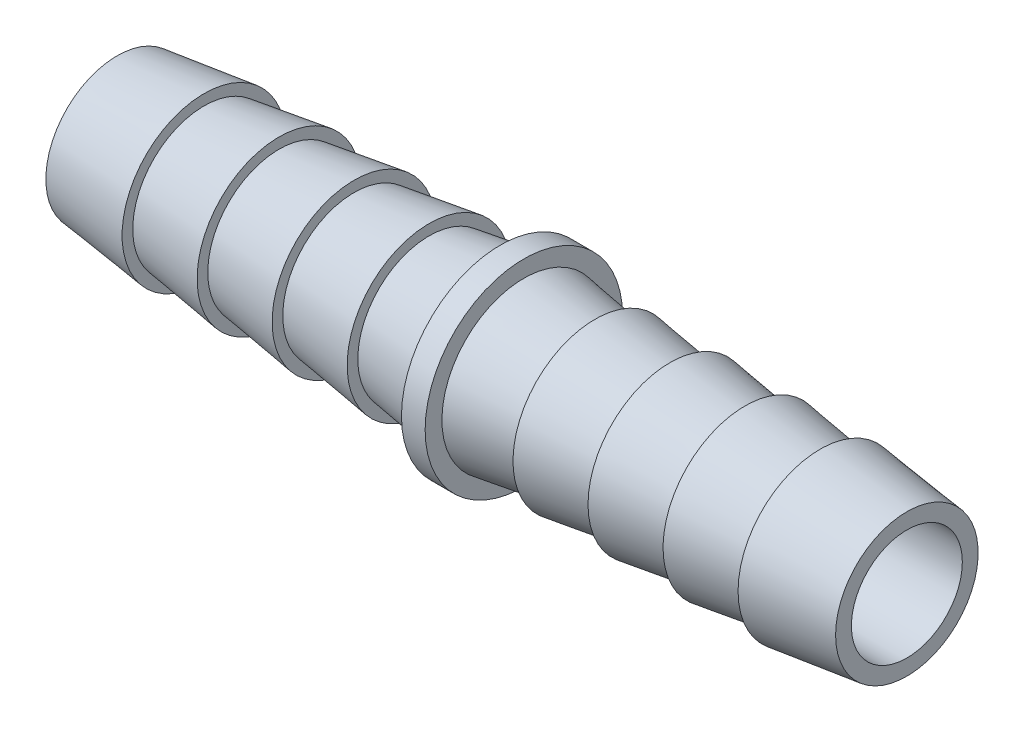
ISO-10303-21;
HEADER;
FILE_DESCRIPTION(('STEP AP214'),'2;1');
FILE_NAME('part.step','',(''),(''),'','','');
FILE_SCHEMA(('AUTOMOTIVE_DESIGN { 1 0 10303 214 1 1 1 1 }'));
ENDSEC;
DATA;
#1=APPLICATION_CONTEXT('core data for automotive mechanical design processes');
#2=APPLICATION_PROTOCOL_DEFINITION('international standard','automotive_design',2000,#1);
#3=PRODUCT_CONTEXT('',#1,'mechanical');
#4=PRODUCT('Part','Part','',(#3));
#5=PRODUCT_RELATED_PRODUCT_CATEGORY('part','',(#4));
#6=PRODUCT_DEFINITION_FORMATION('','',#4);
#7=PRODUCT_DEFINITION_CONTEXT('part definition',#1,'design');
#8=PRODUCT_DEFINITION('design','',#6,#7);
#9=PRODUCT_DEFINITION_SHAPE('','',#8);
#10=(LENGTH_UNIT() NAMED_UNIT(*) SI_UNIT(.MILLI.,.METRE.));
#11=(NAMED_UNIT(*) PLANE_ANGLE_UNIT() SI_UNIT($,.RADIAN.));
#12=(NAMED_UNIT(*) SI_UNIT($,.STERADIAN.) SOLID_ANGLE_UNIT());
#13=UNCERTAINTY_MEASURE_WITH_UNIT(LENGTH_MEASURE(1.E-05),#10,'distance_accuracy_value','');
#14=(GEOMETRIC_REPRESENTATION_CONTEXT(3) GLOBAL_UNCERTAINTY_ASSIGNED_CONTEXT((#13)) GLOBAL_UNIT_ASSIGNED_CONTEXT((#10,
#11,#12)) REPRESENTATION_CONTEXT('',''));
#15=CARTESIAN_POINT('',(0.,0.,0.));
#16=DIRECTION('',(0.,0.,1.));
#17=DIRECTION('',(1.,0.,0.));
#18=AXIS2_PLACEMENT_3D('',#15,#16,#17);
#19=CARTESIAN_POINT('',(0.,0.,0.));
#20=DIRECTION('',(-1.,0.,0.));
#21=DIRECTION('',(0.,0.,1.));
#22=AXIS2_PLACEMENT_3D('',#19,#20,#21);
#23=CYLINDRICAL_SURFACE('',#22,6.35);
#24=CARTESIAN_POINT('',(-0.762,0.,0.));
#25=DIRECTION('',(-1.,0.,0.));
#26=DIRECTION('',(0.,0.,1.));
#27=AXIS2_PLACEMENT_3D('',#24,#25,#26);
#28=CIRCLE('',#27,6.35);
#29=CARTESIAN_POINT('',(-0.762,0.,6.35));
#30=VERTEX_POINT('',#29);
#31=EDGE_CURVE('E86',#30,#30,#28,.T.);
#32=ORIENTED_EDGE('',*,*,#31,.F.);
#33=EDGE_LOOP('',(#32));
#34=FACE_BOUND('',#33,.T.);
#35=CARTESIAN_POINT('',(0.762,0.,0.));
#36=DIRECTION('',(-1.,0.,0.));
#37=DIRECTION('',(0.,0.,1.));
#38=AXIS2_PLACEMENT_3D('',#35,#36,#37);
#39=CIRCLE('',#38,6.35);
#40=CARTESIAN_POINT('',(0.762,0.,6.35));
#41=VERTEX_POINT('',#40);
#42=EDGE_CURVE('E16',#41,#41,#39,.T.);
#43=ORIENTED_EDGE('',*,*,#42,.T.);
#44=EDGE_LOOP('',(#43));
#45=FACE_BOUND('',#44,.T.);
#46=ADVANCED_FACE('F12',(#34,#45),#23,.T.);
#47=CARTESIAN_POINT('',(0.762,0.,0.));
#48=DIRECTION('',(-1.,0.,0.));
#49=DIRECTION('',(0.,0.,1.));
#50=AXIS2_PLACEMENT_3D('',#47,#48,#49);
#51=PLANE('',#50);
#52=CARTESIAN_POINT('',(0.761999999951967,0.,0.));
#53=DIRECTION('',(-1.,0.,0.));
#54=DIRECTION('',(0.,-1.,0.));
#55=AXIS2_PLACEMENT_3D('',#52,#53,#54);
#56=CIRCLE('',#55,5.27049999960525);
#57=CARTESIAN_POINT('',(0.761999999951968,-5.27049999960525,0.));
#58=VERTEX_POINT('',#57);
#59=EDGE_CURVE('E84',#58,#58,#56,.F.);
#60=ORIENTED_EDGE('',*,*,#59,.F.);
#61=EDGE_LOOP('',(#60));
#62=FACE_BOUND('',#61,.T.);
#63=ORIENTED_EDGE('',*,*,#42,.F.);
#64=EDGE_LOOP('',(#63));
#65=FACE_BOUND('',#64,.T.);
#66=ADVANCED_FACE('F94',(#62,#65),#51,.F.);
#67=CARTESIAN_POINT('',(-0.762,0.,0.));
#68=DIRECTION('',(-1.,0.,0.));
#69=DIRECTION('',(0.,0.,1.));
#70=AXIS2_PLACEMENT_3D('',#67,#68,#69);
#71=PLANE('',#70);
#72=CARTESIAN_POINT('',(-0.762,0.,0.));
#73=DIRECTION('',(1.,0.,0.));
#74=DIRECTION('',(0.,0.,-1.));
#75=AXIS2_PLACEMENT_3D('',#72,#73,#74);
#76=CIRCLE('',#75,5.2705);
#77=CARTESIAN_POINT('',(-0.762,0.,-5.2705));
#78=VERTEX_POINT('',#77);
#79=EDGE_CURVE('E81',#78,#78,#76,.F.);
#80=ORIENTED_EDGE('',*,*,#79,.F.);
#81=EDGE_LOOP('',(#80));
#82=FACE_BOUND('',#81,.T.);
#83=ORIENTED_EDGE('',*,*,#31,.T.);
#84=EDGE_LOOP('',(#83));
#85=FACE_BOUND('',#84,.T.);
#86=ADVANCED_FACE('F96',(#82,#85),#71,.T.);
#87=CARTESIAN_POINT('',(0.762000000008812,0.,0.));
#88=DIRECTION('',(-1.,0.,0.));
#89=DIRECTION('',(0.,-1.,0.));
#90=AXIS2_PLACEMENT_3D('',#87,#88,#89);
#91=CONICAL_SURFACE('',#90,5.27049999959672,0.148889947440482);
#92=CARTESIAN_POINT('',(5.33400000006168,0.,0.));
#93=DIRECTION('',(-1.,0.,0.));
#94=DIRECTION('',(0.,-1.,0.));
#95=AXIS2_PLACEMENT_3D('',#92,#93,#94);
#96=CIRCLE('',#95,4.58470000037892);
#97=CARTESIAN_POINT('',(5.33400000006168,-4.58470000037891,0.));
#98=VERTEX_POINT('',#97);
#99=EDGE_CURVE('E78',#98,#98,#96,.F.);
#100=ORIENTED_EDGE('',*,*,#99,.F.);
#101=EDGE_LOOP('',(#100));
#102=FACE_BOUND('',#101,.T.);
#103=ORIENTED_EDGE('',*,*,#59,.T.);
#104=EDGE_LOOP('',(#103));
#105=FACE_BOUND('',#104,.T.);
#106=ADVANCED_FACE('F104',(#102,#105),#91,.T.);
#107=CARTESIAN_POINT('',(-0.762,0.,0.));
#108=DIRECTION('',(1.,0.,0.));
#109=DIRECTION('',(0.,0.,-1.));
#110=AXIS2_PLACEMENT_3D('',#107,#108,#109);
#111=CONICAL_SURFACE('',#110,5.2705,0.148889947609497);
#112=ORIENTED_EDGE('',*,*,#79,.T.);
#113=EDGE_LOOP('',(#112));
#114=FACE_BOUND('',#113,.T.);
#115=CARTESIAN_POINT('',(-5.334,0.,0.));
#116=DIRECTION('',(1.,0.,0.));
#117=DIRECTION('',(0.,0.,-1.));
#118=AXIS2_PLACEMENT_3D('',#115,#116,#117);
#119=CIRCLE('',#118,4.5847);
#120=CARTESIAN_POINT('',(-5.334,0.,-4.5847));
#121=VERTEX_POINT('',#120);
#122=EDGE_CURVE('E75',#121,#121,#119,.F.);
#123=ORIENTED_EDGE('',*,*,#122,.F.);
#124=EDGE_LOOP('',(#123));
#125=FACE_BOUND('',#124,.T.);
#126=ADVANCED_FACE('F175',(#114,#125),#111,.T.);
#127=CARTESIAN_POINT('',(5.334,4.9276,0.));
#128=DIRECTION('',(-1.,0.,0.));
#129=DIRECTION('',(0.,0.,1.));
#130=AXIS2_PLACEMENT_3D('',#127,#128,#129);
#131=PLANE('',#130);
#132=ORIENTED_EDGE('',*,*,#99,.T.);
#133=EDGE_LOOP('',(#132));
#134=FACE_BOUND('',#133,.T.);
#135=CARTESIAN_POINT('',(5.33399999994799,0.,0.));
#136=DIRECTION('',(-1.,0.,0.));
#137=DIRECTION('',(0.,-1.,0.));
#138=AXIS2_PLACEMENT_3D('',#135,#136,#137);
#139=CIRCLE('',#138,5.27049999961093);
#140=CARTESIAN_POINT('',(5.33399999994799,-5.27049999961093,0.));
#141=VERTEX_POINT('',#140);
#142=EDGE_CURVE('E72',#141,#141,#139,.F.);
#143=ORIENTED_EDGE('',*,*,#142,.F.);
#144=EDGE_LOOP('',(#143));
#145=FACE_BOUND('',#144,.T.);
#146=ADVANCED_FACE('F172',(#134,#145),#131,.T.);
#147=CARTESIAN_POINT('',(-5.334,5.2705,-5.37591));
#148=DIRECTION('',(1.,0.,0.));
#149=DIRECTION('',(0.,0.,1.));
#150=AXIS2_PLACEMENT_3D('',#147,#148,#149);
#151=PLANE('',#150);
#152=ORIENTED_EDGE('',*,*,#122,.T.);
#153=EDGE_LOOP('',(#152));
#154=FACE_BOUND('',#153,.T.);
#155=CARTESIAN_POINT('',(-5.334,0.,0.));
#156=DIRECTION('',(1.,0.,0.));
#157=DIRECTION('',(0.,0.,-1.));
#158=AXIS2_PLACEMENT_3D('',#155,#156,#157);
#159=CIRCLE('',#158,5.2705);
#160=CARTESIAN_POINT('',(-5.334,0.,-5.2705));
#161=VERTEX_POINT('',#160);
#162=EDGE_CURVE('E69',#161,#161,#159,.F.);
#163=ORIENTED_EDGE('',*,*,#162,.F.);
#164=EDGE_LOOP('',(#163));
#165=FACE_BOUND('',#164,.T.);
#166=ADVANCED_FACE('F170',(#154,#165),#151,.T.);
#167=CARTESIAN_POINT('',(5.33399999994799,0.,0.));
#168=DIRECTION('',(-1.,0.,0.));
#169=DIRECTION('',(0.,-1.,0.));
#170=AXIS2_PLACEMENT_3D('',#167,#168,#169);
#171=CONICAL_SURFACE('',#170,5.27049999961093,0.141160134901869);
#172=CARTESIAN_POINT('',(10.1600000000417,0.,0.));
#173=DIRECTION('',(-1.,0.,0.));
#174=DIRECTION('',(0.,-1.,0.));
#175=AXIS2_PLACEMENT_3D('',#172,#173,#174);
#176=CIRCLE('',#175,4.58470000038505);
#177=CARTESIAN_POINT('',(10.1600000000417,-4.58470000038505,0.));
#178=VERTEX_POINT('',#177);
#179=EDGE_CURVE('E66',#178,#178,#176,.F.);
#180=ORIENTED_EDGE('',*,*,#179,.F.);
#181=EDGE_LOOP('',(#180));
#182=FACE_BOUND('',#181,.T.);
#183=ORIENTED_EDGE('',*,*,#142,.T.);
#184=EDGE_LOOP('',(#183));
#185=FACE_BOUND('',#184,.T.);
#186=ADVANCED_FACE('F167',(#182,#185),#171,.T.);
#187=CARTESIAN_POINT('',(-5.334,0.,0.));
#188=DIRECTION('',(1.,0.,0.));
#189=DIRECTION('',(0.,0.,-1.));
#190=AXIS2_PLACEMENT_3D('',#187,#188,#189);
#191=CONICAL_SURFACE('',#190,5.2705,0.141160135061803);
#192=ORIENTED_EDGE('',*,*,#162,.T.);
#193=EDGE_LOOP('',(#192));
#194=FACE_BOUND('',#193,.T.);
#195=CARTESIAN_POINT('',(-10.16,0.,0.));
#196=DIRECTION('',(1.,0.,0.));
#197=DIRECTION('',(0.,0.,-1.));
#198=AXIS2_PLACEMENT_3D('',#195,#196,#197);
#199=CIRCLE('',#198,4.5847);
#200=CARTESIAN_POINT('',(-10.16,0.,-4.5847));
#201=VERTEX_POINT('',#200);
#202=EDGE_CURVE('E63',#201,#201,#199,.F.);
#203=ORIENTED_EDGE('',*,*,#202,.F.);
#204=EDGE_LOOP('',(#203));
#205=FACE_BOUND('',#204,.T.);
#206=ADVANCED_FACE('F165',(#194,#205),#191,.T.);
#207=CARTESIAN_POINT('',(10.16,4.9276,0.));
#208=DIRECTION('',(-1.,0.,0.));
#209=DIRECTION('',(0.,0.,1.));
#210=AXIS2_PLACEMENT_3D('',#207,#208,#209);
#211=PLANE('',#210);
#212=ORIENTED_EDGE('',*,*,#179,.T.);
#213=EDGE_LOOP('',(#212));
#214=FACE_BOUND('',#213,.T.);
#215=CARTESIAN_POINT('',(10.159999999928,0.,0.));
#216=DIRECTION('',(-1.,0.,0.));
#217=DIRECTION('',(0.,0.,1.));
#218=AXIS2_PLACEMENT_3D('',#215,#216,#217);
#219=CIRCLE('',#218,5.27049999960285);
#220=CARTESIAN_POINT('',(10.159999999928,0.,5.27049999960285));
#221=VERTEX_POINT('',#220);
#222=EDGE_CURVE('E60',#221,#221,#219,.F.);
#223=ORIENTED_EDGE('',*,*,#222,.F.);
#224=EDGE_LOOP('',(#223));
#225=FACE_BOUND('',#224,.T.);
#226=ADVANCED_FACE('F162',(#214,#225),#211,.T.);
#227=CARTESIAN_POINT('',(-10.16,5.2705,-5.37591));
#228=DIRECTION('',(1.,0.,0.));
#229=DIRECTION('',(0.,0.,1.));
#230=AXIS2_PLACEMENT_3D('',#227,#228,#229);
#231=PLANE('',#230);
#232=ORIENTED_EDGE('',*,*,#202,.T.);
#233=EDGE_LOOP('',(#232));
#234=FACE_BOUND('',#233,.T.);
#235=CARTESIAN_POINT('',(-10.16,0.,0.));
#236=DIRECTION('',(1.,0.,0.));
#237=DIRECTION('',(0.,0.,-1.));
#238=AXIS2_PLACEMENT_3D('',#235,#236,#237);
#239=CIRCLE('',#238,5.2705);
#240=CARTESIAN_POINT('',(-10.16,0.,-5.2705));
#241=VERTEX_POINT('',#240);
#242=EDGE_CURVE('E57',#241,#241,#239,.F.);
#243=ORIENTED_EDGE('',*,*,#242,.F.);
#244=EDGE_LOOP('',(#243));
#245=FACE_BOUND('',#244,.T.);
#246=ADVANCED_FACE('F160',(#234,#245),#231,.T.);
#247=CARTESIAN_POINT('',(10.1599999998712,0.,0.));
#248=DIRECTION('',(-1.,0.,0.));
#249=DIRECTION('',(0.,0.,1.));
#250=AXIS2_PLACEMENT_3D('',#247,#248,#249);
#251=CONICAL_SURFACE('',#250,5.27049999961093,0.141160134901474);
#252=CARTESIAN_POINT('',(14.9860000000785,0.,0.));
#253=DIRECTION('',(-1.,0.,0.));
#254=DIRECTION('',(0.,0.,1.));
#255=AXIS2_PLACEMENT_3D('',#252,#253,#254);
#256=CIRCLE('',#255,4.58470000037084);
#257=CARTESIAN_POINT('',(14.9860000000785,0.,4.58470000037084));
#258=VERTEX_POINT('',#257);
#259=EDGE_CURVE('E54',#258,#258,#256,.F.);
#260=ORIENTED_EDGE('',*,*,#259,.F.);
#261=EDGE_LOOP('',(#260));
#262=FACE_BOUND('',#261,.T.);
#263=ORIENTED_EDGE('',*,*,#222,.T.);
#264=EDGE_LOOP('',(#263));
#265=FACE_BOUND('',#264,.T.);
#266=ADVANCED_FACE('F157',(#262,#265),#251,.T.);
#267=CARTESIAN_POINT('',(-10.16,0.,0.));
#268=DIRECTION('',(1.,0.,0.));
#269=DIRECTION('',(0.,0.,-1.));
#270=AXIS2_PLACEMENT_3D('',#267,#268,#269);
#271=CONICAL_SURFACE('',#270,5.2705,0.141160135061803);
#272=ORIENTED_EDGE('',*,*,#242,.T.);
#273=EDGE_LOOP('',(#272));
#274=FACE_BOUND('',#273,.T.);
#275=CARTESIAN_POINT('',(-14.986,0.,0.));
#276=DIRECTION('',(1.,0.,0.));
#277=DIRECTION('',(0.,0.,-1.));
#278=AXIS2_PLACEMENT_3D('',#275,#276,#277);
#279=CIRCLE('',#278,4.5847);
#280=CARTESIAN_POINT('',(-14.986,0.,-4.5847));
#281=VERTEX_POINT('',#280);
#282=EDGE_CURVE('E51',#281,#281,#279,.F.);
#283=ORIENTED_EDGE('',*,*,#282,.F.);
#284=EDGE_LOOP('',(#283));
#285=FACE_BOUND('',#284,.T.);
#286=ADVANCED_FACE('F155',(#274,#285),#271,.T.);
#287=CARTESIAN_POINT('',(14.986,4.9276,0.));
#288=DIRECTION('',(-1.,0.,0.));
#289=DIRECTION('',(0.,0.,1.));
#290=AXIS2_PLACEMENT_3D('',#287,#288,#289);
#291=PLANE('',#290);
#292=ORIENTED_EDGE('',*,*,#259,.T.);
#293=EDGE_LOOP('',(#292));
#294=FACE_BOUND('',#293,.T.);
#295=CARTESIAN_POINT('',(14.9859999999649,0.,0.));
#296=DIRECTION('',(-1.,0.,0.));
#297=DIRECTION('',(0.,-1.,0.));
#298=AXIS2_PLACEMENT_3D('',#295,#296,#297);
#299=CIRCLE('',#298,5.27049999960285);
#300=CARTESIAN_POINT('',(14.9859999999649,-5.27049999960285,0.));
#301=VERTEX_POINT('',#300);
#302=EDGE_CURVE('E48',#301,#301,#299,.F.);
#303=ORIENTED_EDGE('',*,*,#302,.F.);
#304=EDGE_LOOP('',(#303));
#305=FACE_BOUND('',#304,.T.);
#306=ADVANCED_FACE('F152',(#294,#305),#291,.T.);
#307=CARTESIAN_POINT('',(-14.986,5.2705,-5.37591));
#308=DIRECTION('',(1.,0.,0.));
#309=DIRECTION('',(0.,0.,1.));
#310=AXIS2_PLACEMENT_3D('',#307,#308,#309);
#311=PLANE('',#310);
#312=ORIENTED_EDGE('',*,*,#282,.T.);
#313=EDGE_LOOP('',(#312));
#314=FACE_BOUND('',#313,.T.);
#315=CARTESIAN_POINT('',(-14.986,0.,0.));
#316=DIRECTION('',(1.,0.,0.));
#317=DIRECTION('',(0.,0.,-1.));
#318=AXIS2_PLACEMENT_3D('',#315,#316,#317);
#319=CIRCLE('',#318,5.2705);
#320=CARTESIAN_POINT('',(-14.986,0.,-5.27050000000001));
#321=VERTEX_POINT('',#320);
#322=EDGE_CURVE('E45',#321,#321,#319,.F.);
#323=ORIENTED_EDGE('',*,*,#322,.F.);
#324=EDGE_LOOP('',(#323));
#325=FACE_BOUND('',#324,.T.);
#326=ADVANCED_FACE('F150',(#314,#325),#311,.T.);
#327=CARTESIAN_POINT('',(14.985999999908,0.,0.));
#328=DIRECTION('',(-1.,0.,0.));
#329=DIRECTION('',(0.,-1.,0.));
#330=AXIS2_PLACEMENT_3D('',#327,#328,#329);
#331=CONICAL_SURFACE('',#330,5.27049999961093,0.141160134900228);
#332=CARTESIAN_POINT('',(19.8120000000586,0.,0.));
#333=DIRECTION('',(-1.,0.,0.));
#334=DIRECTION('',(0.,-1.,0.));
#335=AXIS2_PLACEMENT_3D('',#332,#333,#334);
#336=CIRCLE('',#335,4.58470000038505);
#337=CARTESIAN_POINT('',(19.8120000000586,-4.58470000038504,0.));
#338=VERTEX_POINT('',#337);
#339=EDGE_CURVE('E42',#338,#338,#336,.F.);
#340=ORIENTED_EDGE('',*,*,#339,.F.);
#341=EDGE_LOOP('',(#340));
#342=FACE_BOUND('',#341,.T.);
#343=ORIENTED_EDGE('',*,*,#302,.T.);
#344=EDGE_LOOP('',(#343));
#345=FACE_BOUND('',#344,.T.);
#346=ADVANCED_FACE('F144',(#342,#345),#331,.T.);
#347=CARTESIAN_POINT('',(-14.986,0.,0.));
#348=DIRECTION('',(1.,0.,0.));
#349=DIRECTION('',(0.,0.,-1.));
#350=AXIS2_PLACEMENT_3D('',#347,#348,#349);
#351=CONICAL_SURFACE('',#350,5.2705,0.141160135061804);
#352=ORIENTED_EDGE('',*,*,#322,.T.);
#353=EDGE_LOOP('',(#352));
#354=FACE_BOUND('',#353,.T.);
#355=CARTESIAN_POINT('',(-19.812,0.,0.));
#356=DIRECTION('',(1.,0.,0.));
#357=DIRECTION('',(0.,0.,-1.));
#358=AXIS2_PLACEMENT_3D('',#355,#356,#357);
#359=CIRCLE('',#358,4.5847);
#360=CARTESIAN_POINT('',(-19.812,0.,-4.58470000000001));
#361=VERTEX_POINT('',#360);
#362=EDGE_CURVE('E39',#361,#361,#359,.F.);
#363=ORIENTED_EDGE('',*,*,#362,.F.);
#364=EDGE_LOOP('',(#363));
#365=FACE_BOUND('',#364,.T.);
#366=ADVANCED_FACE('F135',(#354,#365),#351,.T.);
#367=CARTESIAN_POINT('',(19.812,2.63525,0.));
#368=DIRECTION('',(-1.,0.,0.));
#369=DIRECTION('',(0.,0.,1.));
#370=AXIS2_PLACEMENT_3D('',#367,#368,#369);
#371=PLANE('',#370);
#372=ORIENTED_EDGE('',*,*,#339,.T.);
#373=EDGE_LOOP('',(#372));
#374=FACE_BOUND('',#373,.T.);
#375=CARTESIAN_POINT('',(19.8119999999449,0.,0.));
#376=DIRECTION('',(-1.,0.,0.));
#377=DIRECTION('',(0.,0.,1.));
#378=AXIS2_PLACEMENT_3D('',#375,#376,#377);
#379=CIRCLE('',#378,5.27049999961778);
#380=CARTESIAN_POINT('',(19.8119999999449,0.,5.27049999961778));
#381=VERTEX_POINT('',#380);
#382=EDGE_CURVE('E36',#381,#381,#379,.F.);
#383=ORIENTED_EDGE('',*,*,#382,.F.);
#384=EDGE_LOOP('',(#383));
#385=FACE_BOUND('',#384,.T.);
#386=ADVANCED_FACE('F133',(#374,#385),#371,.T.);
#387=CARTESIAN_POINT('',(-19.812,5.2705,-5.37591));
#388=DIRECTION('',(1.,0.,0.));
#389=DIRECTION('',(0.,0.,1.));
#390=AXIS2_PLACEMENT_3D('',#387,#388,#389);
#391=PLANE('',#390);
#392=ORIENTED_EDGE('',*,*,#362,.T.);
#393=EDGE_LOOP('',(#392));
#394=FACE_BOUND('',#393,.T.);
#395=CARTESIAN_POINT('',(-19.812,0.,0.));
#396=DIRECTION('',(1.,0.,0.));
#397=DIRECTION('',(0.,0.,-1.));
#398=AXIS2_PLACEMENT_3D('',#395,#396,#397);
#399=CIRCLE('',#398,5.2705);
#400=CARTESIAN_POINT('',(-19.812,0.,-5.2705));
#401=VERTEX_POINT('',#400);
#402=EDGE_CURVE('E33',#401,#401,#399,.F.);
#403=ORIENTED_EDGE('',*,*,#402,.F.);
#404=EDGE_LOOP('',(#403));
#405=FACE_BOUND('',#404,.T.);
#406=ADVANCED_FACE('F129',(#394,#405),#391,.T.);
#407=CARTESIAN_POINT('',(19.8120000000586,0.,0.));
#408=DIRECTION('',(-1.,0.,0.));
#409=DIRECTION('',(0.,0.,1.));
#410=AXIS2_PLACEMENT_3D('',#407,#408,#409);
#411=CONICAL_SURFACE('',#410,5.27049999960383,0.122116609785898);
#412=CARTESIAN_POINT('',(25.4000000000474,0.,0.));
#413=DIRECTION('',(-1.,0.,0.));
#414=DIRECTION('',(0.,0.,1.));
#415=AXIS2_PLACEMENT_3D('',#412,#413,#414);
#416=CIRCLE('',#415,4.58470000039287);
#417=CARTESIAN_POINT('',(25.4000000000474,0.,4.58470000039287));
#418=VERTEX_POINT('',#417);
#419=EDGE_CURVE('E30',#418,#418,#416,.F.);
#420=ORIENTED_EDGE('',*,*,#419,.F.);
#421=EDGE_LOOP('',(#420));
#422=FACE_BOUND('',#421,.T.);
#423=ORIENTED_EDGE('',*,*,#382,.T.);
#424=EDGE_LOOP('',(#423));
#425=FACE_BOUND('',#424,.T.);
#426=ADVANCED_FACE('F126',(#422,#425),#411,.T.);
#427=CARTESIAN_POINT('',(-19.812,0.,0.));
#428=DIRECTION('',(1.,0.,0.));
#429=DIRECTION('',(0.,0.,-1.));
#430=AXIS2_PLACEMENT_3D('',#427,#428,#429);
#431=CONICAL_SURFACE('',#430,5.2705,0.122116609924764);
#432=ORIENTED_EDGE('',*,*,#402,.T.);
#433=EDGE_LOOP('',(#432));
#434=FACE_BOUND('',#433,.T.);
#435=CARTESIAN_POINT('',(-25.4,0.,0.));
#436=DIRECTION('',(1.,0.,0.));
#437=DIRECTION('',(0.,0.,-1.));
#438=AXIS2_PLACEMENT_3D('',#435,#436,#437);
#439=CIRCLE('',#438,4.5847);
#440=CARTESIAN_POINT('',(-25.4,0.,-4.5847));
#441=VERTEX_POINT('',#440);
#442=EDGE_CURVE('E25',#441,#441,#439,.F.);
#443=ORIENTED_EDGE('',*,*,#442,.F.);
#444=EDGE_LOOP('',(#443));
#445=FACE_BOUND('',#444,.T.);
#446=ADVANCED_FACE('F122',(#434,#445),#431,.T.);
#447=CARTESIAN_POINT('',(25.4,2.29235,0.));
#448=DIRECTION('',(1.,0.,0.));
#449=DIRECTION('',(0.,0.,-1.));
#450=AXIS2_PLACEMENT_3D('',#447,#448,#449);
#451=PLANE('',#450);
#452=CARTESIAN_POINT('',(25.4,0.,0.));
#453=DIRECTION('',(1.,0.,0.));
#454=DIRECTION('',(0.,0.,-1.));
#455=AXIS2_PLACEMENT_3D('',#452,#453,#454);
#456=CIRCLE('',#455,3.5687);
#457=CARTESIAN_POINT('',(25.4,0.,-3.5687));
#458=VERTEX_POINT('',#457);
#459=EDGE_CURVE('E20',#458,#458,#456,.F.);
#460=ORIENTED_EDGE('',*,*,#459,.T.);
#461=EDGE_LOOP('',(#460));
#462=FACE_BOUND('',#461,.T.);
#463=ORIENTED_EDGE('',*,*,#419,.T.);
#464=EDGE_LOOP('',(#463));
#465=FACE_BOUND('',#464,.T.);
#466=ADVANCED_FACE('F116',(#462,#465),#451,.T.);
#467=CARTESIAN_POINT('',(-25.4,4.5847,4.676394));
#468=DIRECTION('',(-1.,0.,0.));
#469=DIRECTION('',(0.,0.,-1.));
#470=AXIS2_PLACEMENT_3D('',#467,#468,#469);
#471=PLANE('',#470);
#472=CARTESIAN_POINT('',(-25.4,0.,0.));
#473=DIRECTION('',(1.,0.,0.));
#474=DIRECTION('',(0.,0.,-1.));
#475=AXIS2_PLACEMENT_3D('',#472,#473,#474);
#476=CIRCLE('',#475,3.5687);
#477=CARTESIAN_POINT('',(-25.4,0.,-3.5687));
#478=VERTEX_POINT('',#477);
#479=EDGE_CURVE('E8',#478,#478,#476,.T.);
#480=ORIENTED_EDGE('',*,*,#479,.T.);
#481=EDGE_LOOP('',(#480));
#482=FACE_BOUND('',#481,.T.);
#483=ORIENTED_EDGE('',*,*,#442,.T.);
#484=EDGE_LOOP('',(#483));
#485=FACE_BOUND('',#484,.T.);
#486=ADVANCED_FACE('F111',(#482,#485),#471,.T.);
#487=CARTESIAN_POINT('',(-25.4,0.,0.));
#488=DIRECTION('',(1.,0.,0.));
#489=DIRECTION('',(0.,0.,-1.));
#490=AXIS2_PLACEMENT_3D('',#487,#488,#489);
#491=CYLINDRICAL_SURFACE('',#490,3.5687);
#492=ORIENTED_EDGE('',*,*,#479,.F.);
#493=EDGE_LOOP('',(#492));
#494=FACE_BOUND('',#493,.T.);
#495=ORIENTED_EDGE('',*,*,#459,.F.);
#496=EDGE_LOOP('',(#495));
#497=FACE_BOUND('',#496,.T.);
#498=ADVANCED_FACE('F14',(#494,#497),#491,.F.);
#499=CLOSED_SHELL('',(#46,#66,#86,#106,#126,#146,#166,#186,#206,#226,#246,#266,#286,#306,#326,
#346,#366,#386,#406,#426,#446,#466,#486,#498));
#500=MANIFOLD_SOLID_BREP('B1',#499);
#501=ADVANCED_BREP_SHAPE_REPRESENTATION('',(#18,#500),#14);
#502=SHAPE_DEFINITION_REPRESENTATION(#9,#501);
ENDSEC;
END-ISO-10303-21;
